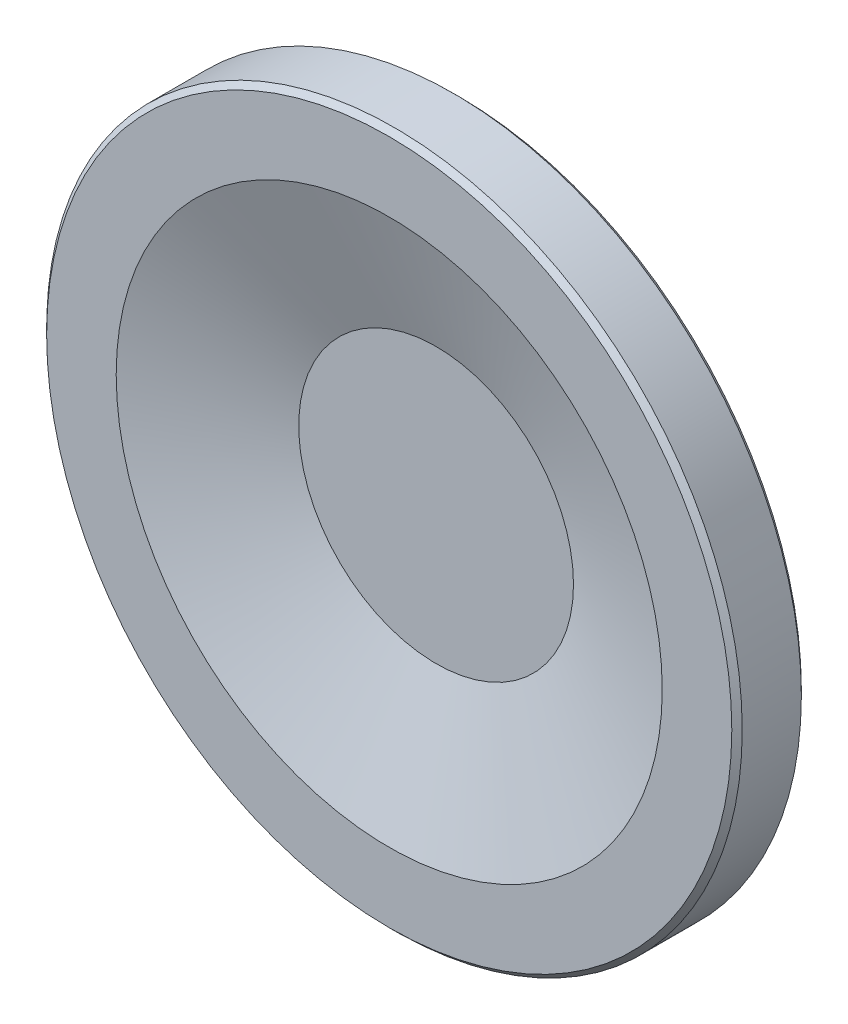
ISO-10303-21;
HEADER;
FILE_DESCRIPTION(('STEP AP214'),'2;1');
FILE_NAME('part.step','',(''),(''),'','','');
FILE_SCHEMA(('AUTOMOTIVE_DESIGN { 1 0 10303 214 1 1 1 1 }'));
ENDSEC;
DATA;
#1=APPLICATION_CONTEXT('core data for automotive mechanical design processes');
#2=APPLICATION_PROTOCOL_DEFINITION('international standard','automotive_design',2000,#1);
#3=PRODUCT_CONTEXT('',#1,'mechanical');
#4=PRODUCT('Part','Part','',(#3));
#5=PRODUCT_RELATED_PRODUCT_CATEGORY('part','',(#4));
#6=PRODUCT_DEFINITION_FORMATION('','',#4);
#7=PRODUCT_DEFINITION_CONTEXT('part definition',#1,'design');
#8=PRODUCT_DEFINITION('design','',#6,#7);
#9=PRODUCT_DEFINITION_SHAPE('','',#8);
#10=(LENGTH_UNIT() NAMED_UNIT(*) SI_UNIT(.MILLI.,.METRE.));
#11=(NAMED_UNIT(*) PLANE_ANGLE_UNIT() SI_UNIT($,.RADIAN.));
#12=(NAMED_UNIT(*) SI_UNIT($,.STERADIAN.) SOLID_ANGLE_UNIT());
#13=UNCERTAINTY_MEASURE_WITH_UNIT(LENGTH_MEASURE(1.E-05),#10,'distance_accuracy_value','');
#14=(GEOMETRIC_REPRESENTATION_CONTEXT(3) GLOBAL_UNCERTAINTY_ASSIGNED_CONTEXT((#13)) GLOBAL_UNIT_ASSIGNED_CONTEXT((#10,
#11,#12)) REPRESENTATION_CONTEXT('',''));
#15=CARTESIAN_POINT('',(0.,0.,0.));
#16=DIRECTION('',(0.,0.,1.));
#17=DIRECTION('',(1.,0.,0.));
#18=AXIS2_PLACEMENT_3D('',#15,#16,#17);
#19=CARTESIAN_POINT('',(0.,0.,55.5));
#20=DIRECTION('',(0.,0.,-1.));
#21=DIRECTION('',(-1.,0.,0.));
#22=AXIS2_PLACEMENT_3D('',#19,#20,#21);
#23=CONICAL_SURFACE('',#22,100.,0.785398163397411);
#24=CARTESIAN_POINT('',(0.,0.,57.));
#25=DIRECTION('',(0.,0.,1.));
#26=DIRECTION('',(1.,0.,0.));
#27=AXIS2_PLACEMENT_3D('',#24,#25,#26);
#28=CIRCLE('',#27,98.5);
#29=CARTESIAN_POINT('',(98.5,0.,57.));
#30=VERTEX_POINT('',#29);
#31=EDGE_CURVE('E8',#30,#30,#28,.T.);
#32=ORIENTED_EDGE('',*,*,#31,.F.);
#33=EDGE_LOOP('',(#32));
#34=FACE_BOUND('',#33,.T.);
#35=CARTESIAN_POINT('',(0.,0.,55.5));
#36=DIRECTION('',(0.,0.,1.));
#37=DIRECTION('',(1.,0.,0.));
#38=AXIS2_PLACEMENT_3D('',#35,#36,#37);
#39=CIRCLE('',#38,100.);
#40=CARTESIAN_POINT('',(100.,0.,55.5));
#41=VERTEX_POINT('',#40);
#42=EDGE_CURVE('E69',#41,#41,#39,.T.);
#43=ORIENTED_EDGE('',*,*,#42,.T.);
#44=EDGE_LOOP('',(#43));
#45=FACE_BOUND('',#44,.T.);
#46=ADVANCED_FACE('F13',(#34,#45),#23,.T.);
#47=CARTESIAN_POINT('',(0.,78.5,57.0000000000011));
#48=DIRECTION('',(0.,0.,1.));
#49=DIRECTION('',(1.,0.,0.));
#50=AXIS2_PLACEMENT_3D('',#47,#48,#49);
#51=PLANE('',#50);
#52=ORIENTED_EDGE('',*,*,#31,.T.);
#53=EDGE_LOOP('',(#52));
#54=FACE_BOUND('',#53,.T.);
#55=CARTESIAN_POINT('',(0.,0.,57.0000000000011));
#56=DIRECTION('',(0.,0.,1.));
#57=DIRECTION('',(1.,0.,0.));
#58=AXIS2_PLACEMENT_3D('',#55,#56,#57);
#59=CIRCLE('',#58,78.5);
#60=CARTESIAN_POINT('',(78.5,0.,57.0000000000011));
#61=VERTEX_POINT('',#60);
#62=EDGE_CURVE('E20',#61,#61,#59,.T.);
#63=ORIENTED_EDGE('',*,*,#62,.F.);
#64=EDGE_LOOP('',(#63));
#65=FACE_BOUND('',#64,.T.);
#66=ADVANCED_FACE('F89',(#54,#65),#51,.T.);
#67=CARTESIAN_POINT('',(0.,0.,43.520738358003));
#68=DIRECTION('',(0.,0.,1.));
#69=DIRECTION('',(1.,0.,0.));
#70=AXIS2_PLACEMENT_3D('',#67,#68,#69);
#71=CONICAL_SURFACE('',#70,39.5,1.23802695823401);
#72=ORIENTED_EDGE('',*,*,#62,.T.);
#73=EDGE_LOOP('',(#72));
#74=FACE_BOUND('',#73,.T.);
#75=CARTESIAN_POINT('',(0.,0.,43.520738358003));
#76=DIRECTION('',(0.,0.,1.));
#77=DIRECTION('',(1.,0.,0.));
#78=AXIS2_PLACEMENT_3D('',#75,#76,#77);
#79=CIRCLE('',#78,39.5);
#80=CARTESIAN_POINT('',(39.5,0.,43.520738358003));
#81=VERTEX_POINT('',#80);
#82=EDGE_CURVE('E26',#81,#81,#79,.T.);
#83=ORIENTED_EDGE('',*,*,#82,.F.);
#84=EDGE_LOOP('',(#83));
#85=FACE_BOUND('',#84,.T.);
#86=ADVANCED_FACE('F95',(#74,#85),#71,.F.);
#87=CARTESIAN_POINT('',(0.,0.,43.520738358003));
#88=DIRECTION('',(0.,0.,1.));
#89=DIRECTION('',(1.,0.,0.));
#90=AXIS2_PLACEMENT_3D('',#87,#88,#89);
#91=PLANE('',#90);
#92=ORIENTED_EDGE('',*,*,#82,.T.);
#93=EDGE_LOOP('',(#92));
#94=FACE_BOUND('',#93,.T.);
#95=ADVANCED_FACE('F100',(#94),#91,.T.);
#96=CARTESIAN_POINT('',(0.,18.5,0.));
#97=DIRECTION('',(0.,0.,-1.));
#98=DIRECTION('',(-1.,0.,0.));
#99=AXIS2_PLACEMENT_3D('',#96,#97,#98);
#100=PLANE('',#99);
#101=CARTESIAN_POINT('',(0.,0.,0.));
#102=DIRECTION('',(0.,0.,1.));
#103=DIRECTION('',(1.,0.,0.));
#104=AXIS2_PLACEMENT_3D('',#101,#102,#103);
#105=CIRCLE('',#104,18.5);
#106=CARTESIAN_POINT('',(18.5,0.,0.));
#107=VERTEX_POINT('',#106);
#108=EDGE_CURVE('E31',#107,#107,#105,.T.);
#109=ORIENTED_EDGE('',*,*,#108,.F.);
#110=EDGE_LOOP('',(#109));
#111=FACE_BOUND('',#110,.T.);
#112=ADVANCED_FACE('F106',(#111),#100,.T.);
#113=CARTESIAN_POINT('',(0.,0.,1.));
#114=DIRECTION('',(0.,0.,1.));
#115=DIRECTION('',(1.,0.,0.));
#116=AXIS2_PLACEMENT_3D('',#113,#114,#115);
#117=CONICAL_SURFACE('',#116,19.5,0.785398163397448);
#118=ORIENTED_EDGE('',*,*,#108,.T.);
#119=EDGE_LOOP('',(#118));
#120=FACE_BOUND('',#119,.T.);
#121=CARTESIAN_POINT('',(0.,0.,1.));
#122=DIRECTION('',(0.,0.,1.));
#123=DIRECTION('',(1.,0.,0.));
#124=AXIS2_PLACEMENT_3D('',#121,#122,#123);
#125=CIRCLE('',#124,19.5);
#126=CARTESIAN_POINT('',(19.5,0.,1.));
#127=VERTEX_POINT('',#126);
#128=EDGE_CURVE('E37',#127,#127,#125,.T.);
#129=ORIENTED_EDGE('',*,*,#128,.F.);
#130=EDGE_LOOP('',(#129));
#131=FACE_BOUND('',#130,.T.);
#132=ADVANCED_FACE('F110',(#120,#131),#117,.T.);
#133=CARTESIAN_POINT('',(0.,0.,72.));
#134=DIRECTION('',(0.,0.,1.));
#135=DIRECTION('',(1.,0.,0.));
#136=AXIS2_PLACEMENT_3D('',#133,#134,#135);
#137=CYLINDRICAL_SURFACE('',#136,19.5);
#138=ORIENTED_EDGE('',*,*,#128,.T.);
#139=EDGE_LOOP('',(#138));
#140=FACE_BOUND('',#139,.T.);
#141=CARTESIAN_POINT('',(0.,0.,18.000000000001));
#142=DIRECTION('',(0.,0.,1.));
#143=DIRECTION('',(1.,0.,0.));
#144=AXIS2_PLACEMENT_3D('',#141,#142,#143);
#145=CIRCLE('',#144,19.5);
#146=CARTESIAN_POINT('',(19.5,0.,18.000000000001));
#147=VERTEX_POINT('',#146);
#148=EDGE_CURVE('E41',#147,#147,#145,.T.);
#149=ORIENTED_EDGE('',*,*,#148,.F.);
#150=EDGE_LOOP('',(#149));
#151=FACE_BOUND('',#150,.T.);
#152=ADVANCED_FACE('F114',(#140,#151),#137,.T.);
#153=CARTESIAN_POINT('',(0.,24.4999999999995,18.000000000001));
#154=DIRECTION('',(0.,0.,-1.));
#155=DIRECTION('',(-1.,0.,0.));
#156=AXIS2_PLACEMENT_3D('',#153,#154,#155);
#157=PLANE('',#156);
#158=ORIENTED_EDGE('',*,*,#148,.T.);
#159=EDGE_LOOP('',(#158));
#160=FACE_BOUND('',#159,.T.);
#161=CARTESIAN_POINT('',(0.,0.,18.000000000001));
#162=DIRECTION('',(0.,0.,1.));
#163=DIRECTION('',(1.,0.,0.));
#164=AXIS2_PLACEMENT_3D('',#161,#162,#163);
#165=CIRCLE('',#164,24.4999999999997);
#166=CARTESIAN_POINT('',(24.4999999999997,0.,18.000000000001));
#167=VERTEX_POINT('',#166);
#168=EDGE_CURVE('E45',#167,#167,#165,.T.);
#169=ORIENTED_EDGE('',*,*,#168,.F.);
#170=EDGE_LOOP('',(#169));
#171=FACE_BOUND('',#170,.T.);
#172=ADVANCED_FACE('F118',(#160,#171),#157,.T.);
#173=CARTESIAN_POINT('',(0.,0.,72.));
#174=DIRECTION('',(0.,0.,1.));
#175=DIRECTION('',(1.,0.,0.));
#176=AXIS2_PLACEMENT_3D('',#173,#174,#175);
#177=CYLINDRICAL_SURFACE('',#176,24.4999999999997);
#178=CARTESIAN_POINT('',(0.,0.,22.027641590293));
#179=DIRECTION('',(0.,0.,1.));
#180=DIRECTION('',(1.,0.,0.));
#181=AXIS2_PLACEMENT_3D('',#178,#179,#180);
#182=CIRCLE('',#181,24.4999999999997);
#183=CARTESIAN_POINT('',(24.4999999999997,0.,22.027641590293));
#184=VERTEX_POINT('',#183);
#185=EDGE_CURVE('E49',#184,#184,#182,.T.);
#186=ORIENTED_EDGE('',*,*,#185,.F.);
#187=EDGE_LOOP('',(#186));
#188=FACE_BOUND('',#187,.T.);
#189=ORIENTED_EDGE('',*,*,#168,.T.);
#190=EDGE_LOOP('',(#189));
#191=FACE_BOUND('',#190,.T.);
#192=ADVANCED_FACE('F122',(#188,#191),#177,.T.);
#193=CARTESIAN_POINT('',(0.,0.,22.027641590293));
#194=DIRECTION('',(0.,0.,1.));
#195=DIRECTION('',(1.,0.,0.));
#196=AXIS2_PLACEMENT_3D('',#193,#194,#195);
#197=TOROIDAL_SURFACE('',#196,30.4999999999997,6.);
#198=ORIENTED_EDGE('',*,*,#185,.T.);
#199=EDGE_LOOP('',(#198));
#200=FACE_BOUND('',#199,.T.);
#201=CARTESIAN_POINT('',(0.,0.,27.6277152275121));
#202=DIRECTION('',(0.,0.,1.));
#203=DIRECTION('',(1.,0.,0.));
#204=AXIS2_PLACEMENT_3D('',#201,#202,#203);
#205=CIRCLE('',#204,28.3461255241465);
#206=CARTESIAN_POINT('',(28.3461255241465,0.,27.6277152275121));
#207=VERTEX_POINT('',#206);
#208=EDGE_CURVE('E53',#207,#207,#205,.T.);
#209=ORIENTED_EDGE('',*,*,#208,.F.);
#210=EDGE_LOOP('',(#209));
#211=FACE_BOUND('',#210,.T.);
#212=ADVANCED_FACE('F126',(#200,#211),#197,.F.);
#213=CARTESIAN_POINT('',(0.,0.,27.6277152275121));
#214=DIRECTION('',(0.,0.,1.));
#215=DIRECTION('',(1.,0.,0.));
#216=AXIS2_PLACEMENT_3D('',#213,#214,#215);
#217=CONICAL_SURFACE('',#216,28.3461255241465,1.2036224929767);
#218=CARTESIAN_POINT('',(0.,0.,37.000000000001));
#219=DIRECTION('',(0.,0.,1.));
#220=DIRECTION('',(1.,0.,0.));
#221=AXIS2_PLACEMENT_3D('',#218,#219,#220);
#222=CIRCLE('',#221,52.7140659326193);
#223=CARTESIAN_POINT('',(52.7140659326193,0.,37.000000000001));
#224=VERTEX_POINT('',#223);
#225=EDGE_CURVE('E57',#224,#224,#222,.T.);
#226=ORIENTED_EDGE('',*,*,#225,.F.);
#227=EDGE_LOOP('',(#226));
#228=FACE_BOUND('',#227,.T.);
#229=ORIENTED_EDGE('',*,*,#208,.T.);
#230=EDGE_LOOP('',(#229));
#231=FACE_BOUND('',#230,.T.);
#232=ADVANCED_FACE('F130',(#228,#231),#217,.T.);
#233=CARTESIAN_POINT('',(0.,52.7140659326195,37.000000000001));
#234=DIRECTION('',(0.,0.,1.));
#235=DIRECTION('',(1.,0.,0.));
#236=AXIS2_PLACEMENT_3D('',#233,#234,#235);
#237=PLANE('',#236);
#238=CARTESIAN_POINT('',(0.,0.,37.000000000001));
#239=DIRECTION('',(0.,0.,1.));
#240=DIRECTION('',(1.,0.,0.));
#241=AXIS2_PLACEMENT_3D('',#238,#239,#240);
#242=CIRCLE('',#241,98.5);
#243=CARTESIAN_POINT('',(98.5,0.,37.000000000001));
#244=VERTEX_POINT('',#243);
#245=EDGE_CURVE('E61',#244,#244,#242,.T.);
#246=ORIENTED_EDGE('',*,*,#245,.F.);
#247=EDGE_LOOP('',(#246));
#248=FACE_BOUND('',#247,.T.);
#249=ORIENTED_EDGE('',*,*,#225,.T.);
#250=EDGE_LOOP('',(#249));
#251=FACE_BOUND('',#250,.T.);
#252=ADVANCED_FACE('F85',(#248,#251),#237,.F.);
#253=CARTESIAN_POINT('',(0.,0.,38.5));
#254=DIRECTION('',(0.,0.,1.));
#255=DIRECTION('',(1.,0.,0.));
#256=AXIS2_PLACEMENT_3D('',#253,#254,#255);
#257=CONICAL_SURFACE('',#256,100.,0.785398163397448);
#258=ORIENTED_EDGE('',*,*,#245,.T.);
#259=EDGE_LOOP('',(#258));
#260=FACE_BOUND('',#259,.T.);
#261=CARTESIAN_POINT('',(0.,0.,38.5));
#262=DIRECTION('',(0.,0.,1.));
#263=DIRECTION('',(1.,0.,0.));
#264=AXIS2_PLACEMENT_3D('',#261,#262,#263);
#265=CIRCLE('',#264,100.);
#266=CARTESIAN_POINT('',(100.,0.,38.5));
#267=VERTEX_POINT('',#266);
#268=EDGE_CURVE('E65',#267,#267,#265,.T.);
#269=ORIENTED_EDGE('',*,*,#268,.F.);
#270=EDGE_LOOP('',(#269));
#271=FACE_BOUND('',#270,.T.);
#272=ADVANCED_FACE('F77',(#260,#271),#257,.T.);
#273=CARTESIAN_POINT('',(0.,0.,72.));
#274=DIRECTION('',(0.,0.,1.));
#275=DIRECTION('',(1.,0.,0.));
#276=AXIS2_PLACEMENT_3D('',#273,#274,#275);
#277=CYLINDRICAL_SURFACE('',#276,100.);
#278=ORIENTED_EDGE('',*,*,#268,.T.);
#279=EDGE_LOOP('',(#278));
#280=FACE_BOUND('',#279,.T.);
#281=ORIENTED_EDGE('',*,*,#42,.F.);
#282=EDGE_LOOP('',(#281));
#283=FACE_BOUND('',#282,.T.);
#284=ADVANCED_FACE('F75',(#280,#283),#277,.T.);
#285=CLOSED_SHELL('',(#46,#66,#86,#95,#112,#132,#152,#172,#192,#212,#232,#252,#272,#284));
#286=MANIFOLD_SOLID_BREP('B1',#285);
#287=ADVANCED_BREP_SHAPE_REPRESENTATION('',(#18,#286),#14);
#288=SHAPE_DEFINITION_REPRESENTATION(#9,#287);
ENDSEC;
END-ISO-10303-21;
